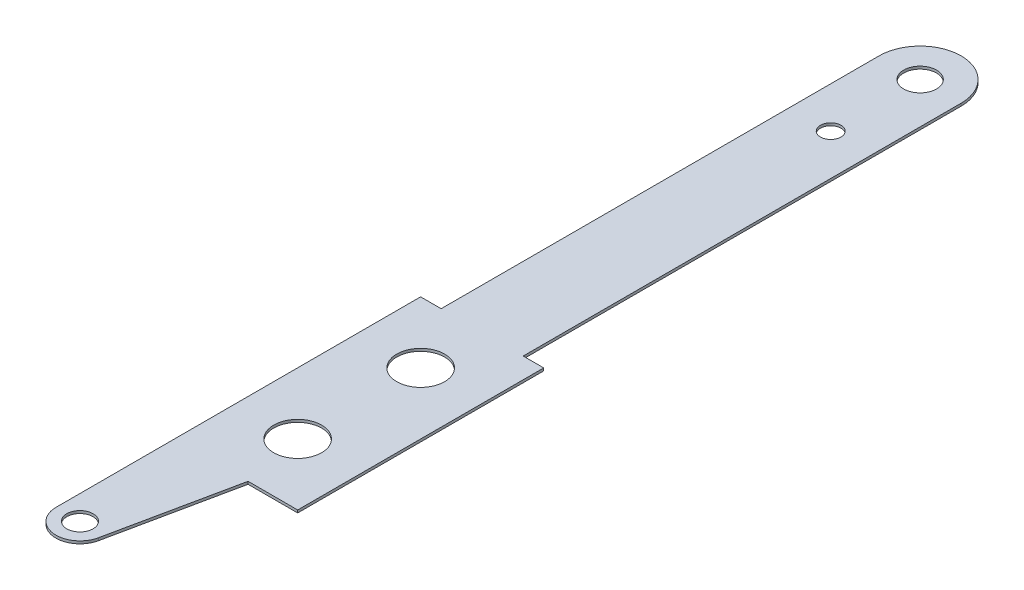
ISO-10303-21;
HEADER;
FILE_DESCRIPTION(('STEP AP214'),'2;1');
FILE_NAME('part.step','',(''),(''),'','','');
FILE_SCHEMA(('AUTOMOTIVE_DESIGN { 1 0 10303 214 1 1 1 1 }'));
ENDSEC;
DATA;
#1=APPLICATION_CONTEXT('core data for automotive mechanical design processes');
#2=APPLICATION_PROTOCOL_DEFINITION('international standard','automotive_design',2000,#1);
#3=PRODUCT_CONTEXT('',#1,'mechanical');
#4=PRODUCT('Part','Part','',(#3));
#5=PRODUCT_RELATED_PRODUCT_CATEGORY('part','',(#4));
#6=PRODUCT_DEFINITION_FORMATION('','',#4);
#7=PRODUCT_DEFINITION_CONTEXT('part definition',#1,'design');
#8=PRODUCT_DEFINITION('design','',#6,#7);
#9=PRODUCT_DEFINITION_SHAPE('','',#8);
#10=(LENGTH_UNIT() NAMED_UNIT(*) SI_UNIT(.MILLI.,.METRE.));
#11=(NAMED_UNIT(*) PLANE_ANGLE_UNIT() SI_UNIT($,.RADIAN.));
#12=(NAMED_UNIT(*) SI_UNIT($,.STERADIAN.) SOLID_ANGLE_UNIT());
#13=UNCERTAINTY_MEASURE_WITH_UNIT(LENGTH_MEASURE(1.E-05),#10,'distance_accuracy_value','');
#14=(GEOMETRIC_REPRESENTATION_CONTEXT(3) GLOBAL_UNCERTAINTY_ASSIGNED_CONTEXT((#13)) GLOBAL_UNIT_ASSIGNED_CONTEXT((#10,
#11,#12)) REPRESENTATION_CONTEXT('',''));
#15=CARTESIAN_POINT('',(0.,0.,0.));
#16=DIRECTION('',(0.,0.,1.));
#17=DIRECTION('',(1.,0.,0.));
#18=AXIS2_PLACEMENT_3D('',#15,#16,#17);
#19=CARTESIAN_POINT('',(-4.76631,-0.2032,9.525));
#20=DIRECTION('',(0.,0.,1.));
#21=DIRECTION('',(1.,0.,0.));
#22=AXIS2_PLACEMENT_3D('',#19,#20,#21);
#23=PLANE('',#22);
#24=DIRECTION('',(1.,0.,0.));
#25=VECTOR('',#24,1.);
#26=CARTESIAN_POINT('',(-4.76631,0.,9.525));
#27=LINE('',#26,#25);
#28=CARTESIAN_POINT('',(0.923290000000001,0.,9.525));
#29=VERTEX_POINT('',#28);
#30=CARTESIAN_POINT('',(4.76631,0.,9.525));
#31=VERTEX_POINT('',#30);
#32=EDGE_CURVE('E138',#29,#31,#27,.T.);
#33=ORIENTED_EDGE('',*,*,#32,.F.);
#34=DIRECTION('',(0.,-1.,0.));
#35=VECTOR('',#34,1.);
#36=CARTESIAN_POINT('',(0.923290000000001,0.,9.525));
#37=LINE('',#36,#35);
#38=CARTESIAN_POINT('',(0.923289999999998,-0.2032,9.525));
#39=VERTEX_POINT('',#38);
#40=EDGE_CURVE('E120',#29,#39,#37,.T.);
#41=ORIENTED_EDGE('',*,*,#40,.T.);
#42=DIRECTION('',(1.,0.,0.));
#43=VECTOR('',#42,1.);
#44=CARTESIAN_POINT('',(-4.76631,-0.2032,9.525));
#45=LINE('',#44,#43);
#46=CARTESIAN_POINT('',(4.76631,-0.2032,9.525));
#47=VERTEX_POINT('',#46);
#48=EDGE_CURVE('E159',#39,#47,#45,.T.);
#49=ORIENTED_EDGE('',*,*,#48,.T.);
#50=DIRECTION('',(0.,1.,0.));
#51=VECTOR('',#50,1.);
#52=CARTESIAN_POINT('',(4.76631,-0.2032,9.525));
#53=LINE('',#52,#51);
#54=EDGE_CURVE('E144',#47,#31,#53,.T.);
#55=ORIENTED_EDGE('',*,*,#54,.T.);
#56=EDGE_LOOP('',(#33,#41,#49,#55));
#57=FACE_BOUND('',#56,.T.);
#58=ADVANCED_FACE('F37',(#57),#23,.T.);
#59=CARTESIAN_POINT('',(-4.76631,-0.2032,-9.525));
#60=DIRECTION('',(0.,0.,-1.));
#61=DIRECTION('',(-1.,0.,0.));
#62=AXIS2_PLACEMENT_3D('',#59,#60,#61);
#63=PLANE('',#62);
#64=DIRECTION('',(-1.,0.,0.));
#65=VECTOR('',#64,1.);
#66=CARTESIAN_POINT('',(-4.76631,-0.2032,-9.525));
#67=LINE('',#66,#65);
#68=CARTESIAN_POINT('',(4.76631,-0.2032,-9.525));
#69=VERTEX_POINT('',#68);
#70=CARTESIAN_POINT('',(3.175,-0.2032,-9.525));
#71=VERTEX_POINT('',#70);
#72=EDGE_CURVE('E185',#69,#71,#67,.T.);
#73=ORIENTED_EDGE('',*,*,#72,.T.);
#74=DIRECTION('',(0.,1.,0.));
#75=VECTOR('',#74,1.);
#76=CARTESIAN_POINT('',(3.175,-0.2032,-9.525));
#77=LINE('',#76,#75);
#78=CARTESIAN_POINT('',(3.17499999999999,0.,-9.525));
#79=VERTEX_POINT('',#78);
#80=EDGE_CURVE('E249',#71,#79,#77,.T.);
#81=ORIENTED_EDGE('',*,*,#80,.T.);
#82=DIRECTION('',(-1.,0.,0.));
#83=VECTOR('',#82,1.);
#84=CARTESIAN_POINT('',(-4.76631,0.,-9.525));
#85=LINE('',#84,#83);
#86=CARTESIAN_POINT('',(4.76631,0.,-9.525));
#87=VERTEX_POINT('',#86);
#88=EDGE_CURVE('E152',#87,#79,#85,.T.);
#89=ORIENTED_EDGE('',*,*,#88,.F.);
#90=DIRECTION('',(0.,1.,0.));
#91=VECTOR('',#90,1.);
#92=CARTESIAN_POINT('',(4.76631,-0.2032,-9.525));
#93=LINE('',#92,#91);
#94=EDGE_CURVE('E170',#69,#87,#93,.T.);
#95=ORIENTED_EDGE('',*,*,#94,.F.);
#96=EDGE_LOOP('',(#73,#81,#89,#95));
#97=FACE_BOUND('',#96,.T.);
#98=ADVANCED_FACE('F285',(#97),#63,.T.);
#99=CARTESIAN_POINT('',(4.76631,-0.2032,9.525));
#100=DIRECTION('',(1.,0.,0.));
#101=DIRECTION('',(0.,0.,-1.));
#102=AXIS2_PLACEMENT_3D('',#99,#100,#101);
#103=PLANE('',#102);
#104=DIRECTION('',(0.,0.,-1.));
#105=VECTOR('',#104,1.);
#106=CARTESIAN_POINT('',(4.76631,0.,9.525));
#107=LINE('',#106,#105);
#108=EDGE_CURVE('E178',#31,#87,#107,.T.);
#109=ORIENTED_EDGE('',*,*,#108,.F.);
#110=ORIENTED_EDGE('',*,*,#54,.F.);
#111=DIRECTION('',(0.,0.,-1.));
#112=VECTOR('',#111,1.);
#113=CARTESIAN_POINT('',(4.76631,-0.2032,9.525));
#114=LINE('',#113,#112);
#115=EDGE_CURVE('E146',#47,#69,#114,.T.);
#116=ORIENTED_EDGE('',*,*,#115,.T.);
#117=ORIENTED_EDGE('',*,*,#94,.T.);
#118=EDGE_LOOP('',(#109,#110,#116,#117));
#119=FACE_BOUND('',#118,.T.);
#120=ADVANCED_FACE('F289',(#119),#103,.T.);
#121=CARTESIAN_POINT('',(-4.76631,-0.2032,9.525));
#122=DIRECTION('',(-1.,0.,0.));
#123=DIRECTION('',(0.,0.,1.));
#124=AXIS2_PLACEMENT_3D('',#121,#122,#123);
#125=PLANE('',#124);
#126=DIRECTION('',(0.,0.,1.));
#127=VECTOR('',#126,1.);
#128=CARTESIAN_POINT('',(-4.76631,0.,9.525));
#129=LINE('',#128,#127);
#130=CARTESIAN_POINT('',(-4.76631,0.,-9.525));
#131=VERTEX_POINT('',#130);
#132=CARTESIAN_POINT('',(-4.76631,0.,18.7126917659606));
#133=VERTEX_POINT('',#132);
#134=EDGE_CURVE('E147',#131,#133,#129,.T.);
#135=ORIENTED_EDGE('',*,*,#134,.F.);
#136=DIRECTION('',(0.,1.,0.));
#137=VECTOR('',#136,1.);
#138=CARTESIAN_POINT('',(-4.76631,-0.2032,-9.525));
#139=LINE('',#138,#137);
#140=CARTESIAN_POINT('',(-4.76631,-0.2032,-9.525));
#141=VERTEX_POINT('',#140);
#142=EDGE_CURVE('E167',#141,#131,#139,.T.);
#143=ORIENTED_EDGE('',*,*,#142,.F.);
#144=DIRECTION('',(0.,0.,1.));
#145=VECTOR('',#144,1.);
#146=CARTESIAN_POINT('',(-4.76631,-0.2032,9.525));
#147=LINE('',#146,#145);
#148=CARTESIAN_POINT('',(-4.76631,-0.2032,18.7126917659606));
#149=VERTEX_POINT('',#148);
#150=EDGE_CURVE('E183',#141,#149,#147,.T.);
#151=ORIENTED_EDGE('',*,*,#150,.T.);
#152=DIRECTION('',(0.,-1.,0.));
#153=VECTOR('',#152,1.);
#154=CARTESIAN_POINT('',(-4.76631,0.,18.7126917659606));
#155=LINE('',#154,#153);
#156=EDGE_CURVE('E219',#133,#149,#155,.T.);
#157=ORIENTED_EDGE('',*,*,#156,.F.);
#158=EDGE_LOOP('',(#135,#143,#151,#157));
#159=FACE_BOUND('',#158,.T.);
#160=ADVANCED_FACE('F206',(#159),#125,.T.);
#161=DIRECTION('',(0.,1.,0.));
#162=VECTOR('',#161,1.);
#163=CARTESIAN_POINT('',(-3.175,-0.2032,-9.525));
#164=LINE('',#163,#162);
#165=CARTESIAN_POINT('',(-3.175,-0.2032,-9.525));
#166=VERTEX_POINT('',#165);
#167=CARTESIAN_POINT('',(-3.175,0.,-9.525));
#168=VERTEX_POINT('',#167);
#169=EDGE_CURVE('E203',#166,#168,#164,.T.);
#170=ORIENTED_EDGE('',*,*,#169,.F.);
#171=EDGE_CURVE('E150',#166,#141,#67,.T.);
#172=ORIENTED_EDGE('',*,*,#171,.T.);
#173=ORIENTED_EDGE('',*,*,#142,.T.);
#174=EDGE_CURVE('E174',#168,#131,#85,.T.);
#175=ORIENTED_EDGE('',*,*,#174,.F.);
#176=EDGE_LOOP('',(#170,#172,#173,#175));
#177=FACE_BOUND('',#176,.T.);
#178=ADVANCED_FACE('F199',(#177),#63,.T.);
#179=CARTESIAN_POINT('',(0.,-0.2032,0.));
#180=DIRECTION('',(0.,-1.,0.));
#181=DIRECTION('',(0.,0.,-1.));
#182=AXIS2_PLACEMENT_3D('',#179,#180,#181);
#183=PLANE('',#182);
#184=CARTESIAN_POINT('',(0.,-0.2032,-43.434));
#185=DIRECTION('',(0.,-1.,0.));
#186=DIRECTION('',(0.,0.,-1.));
#187=AXIS2_PLACEMENT_3D('',#184,#185,#186);
#188=CIRCLE('',#187,1.27);
#189=CARTESIAN_POINT('',(0.,-0.2032,-44.704));
#190=VERTEX_POINT('',#189);
#191=EDGE_CURVE('E362',#190,#190,#188,.T.);
#192=ORIENTED_EDGE('',*,*,#191,.F.);
#193=EDGE_LOOP('',(#192));
#194=FACE_BOUND('',#193,.T.);
#195=CARTESIAN_POINT('',(0.,-0.2032,-36.5125));
#196=DIRECTION('',(0.,1.,0.));
#197=DIRECTION('',(0.,0.,1.));
#198=AXIS2_PLACEMENT_3D('',#195,#196,#197);
#199=CIRCLE('',#198,0.79375);
#200=CARTESIAN_POINT('',(0.,-0.2032,-35.71875));
#201=VERTEX_POINT('',#200);
#202=EDGE_CURVE('E225',#201,#201,#199,.T.);
#203=ORIENTED_EDGE('',*,*,#202,.T.);
#204=EDGE_LOOP('',(#203));
#205=FACE_BOUND('',#204,.T.);
#206=CARTESIAN_POINT('',(0.,-0.2032,4.7625));
#207=DIRECTION('',(0.,1.,0.));
#208=DIRECTION('',(0.,0.,-1.));
#209=AXIS2_PLACEMENT_3D('',#206,#207,#208);
#210=CIRCLE('',#209,1.8542);
#211=CARTESIAN_POINT('',(0.,-0.2032,2.9083));
#212=VERTEX_POINT('',#211);
#213=EDGE_CURVE('E256',#212,#212,#210,.T.);
#214=ORIENTED_EDGE('',*,*,#213,.T.);
#215=EDGE_LOOP('',(#214));
#216=FACE_BOUND('',#215,.T.);
#217=CARTESIAN_POINT('',(0.,-0.2032,-4.7625));
#218=DIRECTION('',(0.,1.,0.));
#219=DIRECTION('',(0.,0.,1.));
#220=AXIS2_PLACEMENT_3D('',#217,#218,#219);
#221=CIRCLE('',#220,1.8542);
#222=CARTESIAN_POINT('',(0.,-0.2032,-2.9083));
#223=VERTEX_POINT('',#222);
#224=EDGE_CURVE('E180',#223,#223,#221,.T.);
#225=ORIENTED_EDGE('',*,*,#224,.T.);
#226=EDGE_LOOP('',(#225));
#227=FACE_BOUND('',#226,.T.);
#228=CARTESIAN_POINT('',(0.,-0.2032,-43.434));
#229=DIRECTION('',(0.,-1.,0.));
#230=DIRECTION('',(0.,0.,-1.));
#231=AXIS2_PLACEMENT_3D('',#228,#229,#230);
#232=CIRCLE('',#231,3.175);
#233=CARTESIAN_POINT('',(-3.175,-0.2032,-43.434));
#234=VERTEX_POINT('',#233);
#235=CARTESIAN_POINT('',(0.,-0.2032,-46.609));
#236=VERTEX_POINT('',#235);
#237=EDGE_CURVE('E53',#234,#236,#232,.T.);
#238=ORIENTED_EDGE('',*,*,#237,.T.);
#239=CARTESIAN_POINT('',(0.,-0.2032,-43.434));
#240=DIRECTION('',(0.,-1.,0.));
#241=DIRECTION('',(0.,0.,-1.));
#242=AXIS2_PLACEMENT_3D('',#239,#240,#241);
#243=CIRCLE('',#242,3.175);
#244=CARTESIAN_POINT('',(3.175,-0.2032,-43.434));
#245=VERTEX_POINT('',#244);
#246=EDGE_CURVE('E46',#236,#245,#243,.T.);
#247=ORIENTED_EDGE('',*,*,#246,.T.);
#248=DIRECTION('',(0.,0.,-1.));
#249=VECTOR('',#248,1.);
#250=CARTESIAN_POINT('',(3.175,-0.2032,-46.609));
#251=LINE('',#250,#249);
#252=EDGE_CURVE('E237',#71,#245,#251,.T.);
#253=ORIENTED_EDGE('',*,*,#252,.F.);
#254=ORIENTED_EDGE('',*,*,#72,.F.);
#255=ORIENTED_EDGE('',*,*,#115,.F.);
#256=ORIENTED_EDGE('',*,*,#48,.F.);
#257=DIRECTION('',(-0.205220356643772,0.,0.978715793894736));
#258=VECTOR('',#257,1.);
#259=CARTESIAN_POINT('',(0.923290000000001,-0.2032,9.525));
#260=LINE('',#259,#258);
#261=CARTESIAN_POINT('',(-1.08331,-0.2032,19.0946701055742));
#262=VERTEX_POINT('',#261);
#263=EDGE_CURVE('E125',#39,#262,#260,.T.);
#264=ORIENTED_EDGE('',*,*,#263,.T.);
#265=CARTESIAN_POINT('',(-2.90500176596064,-0.2032,18.7126917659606));
#266=DIRECTION('',(0.,-1.,0.));
#267=DIRECTION('',(0.,0.,1.));
#268=AXIS2_PLACEMENT_3D('',#265,#266,#267);
#269=CIRCLE('',#268,1.86130823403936);
#270=EDGE_CURVE('E141',#262,#149,#269,.T.);
#271=ORIENTED_EDGE('',*,*,#270,.T.);
#272=ORIENTED_EDGE('',*,*,#150,.F.);
#273=ORIENTED_EDGE('',*,*,#171,.F.);
#274=DIRECTION('',(0.,0.,1.));
#275=VECTOR('',#274,1.);
#276=CARTESIAN_POINT('',(-3.175,-0.2032,-46.609));
#277=LINE('',#276,#275);
#278=EDGE_CURVE('E242',#234,#166,#277,.T.);
#279=ORIENTED_EDGE('',*,*,#278,.F.);
#280=EDGE_LOOP('',(#238,#247,#253,#254,#255,#256,#264,#271,#272,#273,#279));
#281=FACE_BOUND('',#280,.T.);
#282=CARTESIAN_POINT('',(-2.90500176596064,-0.2032,18.7126917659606));
#283=DIRECTION('',(0.,-1.,0.));
#284=DIRECTION('',(0.,0.,-1.));
#285=AXIS2_PLACEMENT_3D('',#282,#283,#284);
#286=CIRCLE('',#285,1.016);
#287=CARTESIAN_POINT('',(-2.90500176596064,-0.2032,17.6966917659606));
#288=VERTEX_POINT('',#287);
#289=EDGE_CURVE('E358',#288,#288,#286,.T.);
#290=ORIENTED_EDGE('',*,*,#289,.F.);
#291=EDGE_LOOP('',(#290));
#292=FACE_BOUND('',#291,.T.);
#293=ADVANCED_FACE('F210',(#194,#205,#216,#227,#281,#292),#183,.T.);
#294=CARTESIAN_POINT('',(0.,0.,0.));
#295=DIRECTION('',(0.,-1.,0.));
#296=DIRECTION('',(0.,0.,-1.));
#297=AXIS2_PLACEMENT_3D('',#294,#295,#296);
#298=PLANE('',#297);
#299=CARTESIAN_POINT('',(0.,0.,-43.434));
#300=DIRECTION('',(0.,-1.,0.));
#301=DIRECTION('',(0.,0.,-1.));
#302=AXIS2_PLACEMENT_3D('',#299,#300,#301);
#303=CIRCLE('',#302,1.27);
#304=CARTESIAN_POINT('',(0.,0.,-44.704));
#305=VERTEX_POINT('',#304);
#306=EDGE_CURVE('E360',#305,#305,#303,.T.);
#307=ORIENTED_EDGE('',*,*,#306,.T.);
#308=EDGE_LOOP('',(#307));
#309=FACE_BOUND('',#308,.T.);
#310=CARTESIAN_POINT('',(0.,0.,-36.5125));
#311=DIRECTION('',(0.,1.,0.));
#312=DIRECTION('',(0.,0.,1.));
#313=AXIS2_PLACEMENT_3D('',#310,#311,#312);
#314=CIRCLE('',#313,0.79375);
#315=CARTESIAN_POINT('',(0.,0.,-35.71875));
#316=VERTEX_POINT('',#315);
#317=EDGE_CURVE('E221',#316,#316,#314,.T.);
#318=ORIENTED_EDGE('',*,*,#317,.F.);
#319=EDGE_LOOP('',(#318));
#320=FACE_BOUND('',#319,.T.);
#321=CARTESIAN_POINT('',(0.,0.,4.7625));
#322=DIRECTION('',(0.,1.,0.));
#323=DIRECTION('',(0.,0.,-1.));
#324=AXIS2_PLACEMENT_3D('',#321,#322,#323);
#325=CIRCLE('',#324,1.8542);
#326=CARTESIAN_POINT('',(0.,0.,2.9083));
#327=VERTEX_POINT('',#326);
#328=EDGE_CURVE('E260',#327,#327,#325,.T.);
#329=ORIENTED_EDGE('',*,*,#328,.F.);
#330=EDGE_LOOP('',(#329));
#331=FACE_BOUND('',#330,.T.);
#332=CARTESIAN_POINT('',(0.,0.,-4.7625));
#333=DIRECTION('',(0.,1.,0.));
#334=DIRECTION('',(0.,0.,1.));
#335=AXIS2_PLACEMENT_3D('',#332,#333,#334);
#336=CIRCLE('',#335,1.8542);
#337=CARTESIAN_POINT('',(0.,0.,-2.9083));
#338=VERTEX_POINT('',#337);
#339=EDGE_CURVE('E259',#338,#338,#336,.T.);
#340=ORIENTED_EDGE('',*,*,#339,.F.);
#341=EDGE_LOOP('',(#340));
#342=FACE_BOUND('',#341,.T.);
#343=DIRECTION('',(0.,0.,-1.));
#344=VECTOR('',#343,1.);
#345=CARTESIAN_POINT('',(3.175,0.,-46.609));
#346=LINE('',#345,#344);
#347=CARTESIAN_POINT('',(3.175,0.,-43.434));
#348=VERTEX_POINT('',#347);
#349=EDGE_CURVE('E238',#79,#348,#346,.T.);
#350=ORIENTED_EDGE('',*,*,#349,.T.);
#351=CARTESIAN_POINT('',(0.,0.,-43.434));
#352=DIRECTION('',(0.,-1.,0.));
#353=DIRECTION('',(0.,0.,-1.));
#354=AXIS2_PLACEMENT_3D('',#351,#352,#353);
#355=CIRCLE('',#354,3.175);
#356=CARTESIAN_POINT('',(0.,0.,-46.609));
#357=VERTEX_POINT('',#356);
#358=EDGE_CURVE('E240',#348,#357,#355,.F.);
#359=ORIENTED_EDGE('',*,*,#358,.T.);
#360=CARTESIAN_POINT('',(0.,0.,-43.434));
#361=DIRECTION('',(0.,-1.,0.));
#362=DIRECTION('',(0.,0.,-1.));
#363=AXIS2_PLACEMENT_3D('',#360,#361,#362);
#364=CIRCLE('',#363,3.175);
#365=CARTESIAN_POINT('',(-3.175,0.,-43.434));
#366=VERTEX_POINT('',#365);
#367=EDGE_CURVE('E234',#357,#366,#364,.F.);
#368=ORIENTED_EDGE('',*,*,#367,.T.);
#369=DIRECTION('',(0.,0.,1.));
#370=VECTOR('',#369,1.);
#371=CARTESIAN_POINT('',(-3.175,0.,-46.609));
#372=LINE('',#371,#370);
#373=EDGE_CURVE('E235',#366,#168,#372,.T.);
#374=ORIENTED_EDGE('',*,*,#373,.T.);
#375=ORIENTED_EDGE('',*,*,#174,.T.);
#376=ORIENTED_EDGE('',*,*,#134,.T.);
#377=CARTESIAN_POINT('',(-2.90500176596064,0.,18.7126917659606));
#378=DIRECTION('',(0.,-1.,0.));
#379=DIRECTION('',(0.,0.,1.));
#380=AXIS2_PLACEMENT_3D('',#377,#378,#379);
#381=CIRCLE('',#380,1.86130823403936);
#382=CARTESIAN_POINT('',(-1.08331,0.,19.0946701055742));
#383=VERTEX_POINT('',#382);
#384=EDGE_CURVE('E130',#383,#133,#381,.T.);
#385=ORIENTED_EDGE('',*,*,#384,.F.);
#386=DIRECTION('',(-0.205220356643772,0.,0.978715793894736));
#387=VECTOR('',#386,1.);
#388=CARTESIAN_POINT('',(0.923290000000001,0.,9.525));
#389=LINE('',#388,#387);
#390=EDGE_CURVE('E123',#29,#383,#389,.T.);
#391=ORIENTED_EDGE('',*,*,#390,.F.);
#392=ORIENTED_EDGE('',*,*,#32,.T.);
#393=ORIENTED_EDGE('',*,*,#108,.T.);
#394=ORIENTED_EDGE('',*,*,#88,.T.);
#395=EDGE_LOOP('',(#350,#359,#368,#374,#375,#376,#385,#391,#392,#393,#394));
#396=FACE_BOUND('',#395,.T.);
#397=CARTESIAN_POINT('',(-2.90500176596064,0.,18.7126917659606));
#398=DIRECTION('',(0.,-1.,0.));
#399=DIRECTION('',(0.,0.,-1.));
#400=AXIS2_PLACEMENT_3D('',#397,#398,#399);
#401=CIRCLE('',#400,1.016);
#402=CARTESIAN_POINT('',(-2.90500176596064,0.,17.6966917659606));
#403=VERTEX_POINT('',#402);
#404=EDGE_CURVE('E215',#403,#403,#401,.T.);
#405=ORIENTED_EDGE('',*,*,#404,.T.);
#406=EDGE_LOOP('',(#405));
#407=FACE_BOUND('',#406,.T.);
#408=ADVANCED_FACE('F135',(#309,#320,#331,#342,#396,#407),#298,.F.);
#409=CARTESIAN_POINT('',(0.,-0.2032,-4.7625));
#410=DIRECTION('',(0.,1.,0.));
#411=DIRECTION('',(0.,0.,1.));
#412=AXIS2_PLACEMENT_3D('',#409,#410,#411);
#413=CYLINDRICAL_SURFACE('',#412,1.8542);
#414=ORIENTED_EDGE('',*,*,#224,.F.);
#415=EDGE_LOOP('',(#414));
#416=FACE_BOUND('',#415,.T.);
#417=ORIENTED_EDGE('',*,*,#339,.T.);
#418=EDGE_LOOP('',(#417));
#419=FACE_BOUND('',#418,.T.);
#420=ADVANCED_FACE('F267',(#416,#419),#413,.F.);
#421=CARTESIAN_POINT('',(0.,-0.2032,4.7625));
#422=DIRECTION('',(0.,1.,0.));
#423=DIRECTION('',(0.,0.,1.));
#424=AXIS2_PLACEMENT_3D('',#421,#422,#423);
#425=CYLINDRICAL_SURFACE('',#424,1.8542);
#426=ORIENTED_EDGE('',*,*,#213,.F.);
#427=EDGE_LOOP('',(#426));
#428=FACE_BOUND('',#427,.T.);
#429=ORIENTED_EDGE('',*,*,#328,.T.);
#430=EDGE_LOOP('',(#429));
#431=FACE_BOUND('',#430,.T.);
#432=ADVANCED_FACE('F276',(#428,#431),#425,.F.);
#433=CARTESIAN_POINT('',(3.175,-0.2032,-46.609));
#434=DIRECTION('',(1.,0.,0.));
#435=DIRECTION('',(0.,0.,-1.));
#436=AXIS2_PLACEMENT_3D('',#433,#434,#435);
#437=PLANE('',#436);
#438=ORIENTED_EDGE('',*,*,#252,.T.);
#439=DIRECTION('',(0.,1.,0.));
#440=VECTOR('',#439,1.);
#441=CARTESIAN_POINT('',(3.175,-0.2032,-43.434));
#442=LINE('',#441,#440);
#443=EDGE_CURVE('E166',#245,#348,#442,.T.);
#444=ORIENTED_EDGE('',*,*,#443,.T.);
#445=ORIENTED_EDGE('',*,*,#349,.F.);
#446=ORIENTED_EDGE('',*,*,#80,.F.);
#447=EDGE_LOOP('',(#438,#444,#445,#446));
#448=FACE_BOUND('',#447,.T.);
#449=ADVANCED_FACE('F315',(#448),#437,.T.);
#450=CARTESIAN_POINT('',(-3.175,-0.2032,-46.609));
#451=DIRECTION('',(-1.,0.,0.));
#452=DIRECTION('',(0.,0.,1.));
#453=AXIS2_PLACEMENT_3D('',#450,#451,#452);
#454=PLANE('',#453);
#455=ORIENTED_EDGE('',*,*,#373,.F.);
#456=DIRECTION('',(0.,1.,0.));
#457=VECTOR('',#456,1.);
#458=CARTESIAN_POINT('',(-3.175,-0.2032,-43.434));
#459=LINE('',#458,#457);
#460=EDGE_CURVE('E11',#366,#234,#459,.F.);
#461=ORIENTED_EDGE('',*,*,#460,.T.);
#462=ORIENTED_EDGE('',*,*,#278,.T.);
#463=ORIENTED_EDGE('',*,*,#169,.T.);
#464=EDGE_LOOP('',(#455,#461,#462,#463));
#465=FACE_BOUND('',#464,.T.);
#466=ADVANCED_FACE('F335',(#465),#454,.T.);
#467=CARTESIAN_POINT('',(0.,-0.2032,-36.5125));
#468=DIRECTION('',(0.,1.,0.));
#469=DIRECTION('',(0.,0.,1.));
#470=AXIS2_PLACEMENT_3D('',#467,#468,#469);
#471=CYLINDRICAL_SURFACE('',#470,0.79375);
#472=ORIENTED_EDGE('',*,*,#202,.F.);
#473=EDGE_LOOP('',(#472));
#474=FACE_BOUND('',#473,.T.);
#475=ORIENTED_EDGE('',*,*,#317,.T.);
#476=EDGE_LOOP('',(#475));
#477=FACE_BOUND('',#476,.T.);
#478=ADVANCED_FACE('F325',(#474,#477),#471,.F.);
#479=CARTESIAN_POINT('',(-2.90500176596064,0.,18.7126917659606));
#480=DIRECTION('',(0.,-1.,0.));
#481=DIRECTION('',(0.,0.,-1.));
#482=AXIS2_PLACEMENT_3D('',#479,#480,#481);
#483=CYLINDRICAL_SURFACE('',#482,1.86130823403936);
#484=ORIENTED_EDGE('',*,*,#270,.F.);
#485=DIRECTION('',(0.,-1.,0.));
#486=VECTOR('',#485,1.);
#487=CARTESIAN_POINT('',(-1.08331,0.,19.0946701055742));
#488=LINE('',#487,#486);
#489=EDGE_CURVE('E129',#383,#262,#488,.T.);
#490=ORIENTED_EDGE('',*,*,#489,.F.);
#491=ORIENTED_EDGE('',*,*,#384,.T.);
#492=ORIENTED_EDGE('',*,*,#156,.T.);
#493=EDGE_LOOP('',(#484,#490,#491,#492));
#494=FACE_BOUND('',#493,.T.);
#495=ADVANCED_FACE('F343',(#494),#483,.T.);
#496=CARTESIAN_POINT('',(0.923290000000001,0.,9.525));
#497=DIRECTION('',(0.978715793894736,0.,0.205220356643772));
#498=DIRECTION('',(0.205220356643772,0.,-0.978715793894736));
#499=AXIS2_PLACEMENT_3D('',#496,#497,#498);
#500=PLANE('',#499);
#501=ORIENTED_EDGE('',*,*,#263,.F.);
#502=ORIENTED_EDGE('',*,*,#40,.F.);
#503=ORIENTED_EDGE('',*,*,#390,.T.);
#504=ORIENTED_EDGE('',*,*,#489,.T.);
#505=EDGE_LOOP('',(#501,#502,#503,#504));
#506=FACE_BOUND('',#505,.T.);
#507=ADVANCED_FACE('F122',(#506),#500,.T.);
#508=CARTESIAN_POINT('',(-2.90500176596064,0.,18.7126917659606));
#509=DIRECTION('',(0.,-1.,0.));
#510=DIRECTION('',(0.,0.,-1.));
#511=AXIS2_PLACEMENT_3D('',#508,#509,#510);
#512=CYLINDRICAL_SURFACE('',#511,1.016);
#513=ORIENTED_EDGE('',*,*,#404,.F.);
#514=EDGE_LOOP('',(#513));
#515=FACE_BOUND('',#514,.T.);
#516=ORIENTED_EDGE('',*,*,#289,.T.);
#517=EDGE_LOOP('',(#516));
#518=FACE_BOUND('',#517,.T.);
#519=ADVANCED_FACE('F307',(#515,#518),#512,.F.);
#520=CARTESIAN_POINT('',(0.,-0.2032,-43.434));
#521=DIRECTION('',(0.,1.,0.));
#522=DIRECTION('',(0.,0.,1.));
#523=AXIS2_PLACEMENT_3D('',#520,#521,#522);
#524=CYLINDRICAL_SURFACE('',#523,3.175);
#525=DIRECTION('',(0.,1.,0.));
#526=VECTOR('',#525,1.);
#527=CARTESIAN_POINT('',(0.,-0.2032,-46.609));
#528=LINE('',#527,#526);
#529=EDGE_CURVE('E41',#236,#357,#528,.T.);
#530=ORIENTED_EDGE('',*,*,#529,.F.);
#531=ORIENTED_EDGE('',*,*,#237,.F.);
#532=ORIENTED_EDGE('',*,*,#460,.F.);
#533=ORIENTED_EDGE('',*,*,#367,.F.);
#534=EDGE_LOOP('',(#530,#531,#532,#533));
#535=FACE_BOUND('',#534,.T.);
#536=ADVANCED_FACE('F39',(#535),#524,.T.);
#537=CARTESIAN_POINT('',(0.,-0.2032,-43.434));
#538=DIRECTION('',(0.,1.,0.));
#539=DIRECTION('',(0.,0.,1.));
#540=AXIS2_PLACEMENT_3D('',#537,#538,#539);
#541=CYLINDRICAL_SURFACE('',#540,3.175);
#542=ORIENTED_EDGE('',*,*,#246,.F.);
#543=ORIENTED_EDGE('',*,*,#529,.T.);
#544=ORIENTED_EDGE('',*,*,#358,.F.);
#545=ORIENTED_EDGE('',*,*,#443,.F.);
#546=EDGE_LOOP('',(#542,#543,#544,#545));
#547=FACE_BOUND('',#546,.T.);
#548=ADVANCED_FACE('F297',(#547),#541,.T.);
#549=CARTESIAN_POINT('',(0.,0.,-43.434));
#550=DIRECTION('',(0.,-1.,0.));
#551=DIRECTION('',(0.,0.,-1.));
#552=AXIS2_PLACEMENT_3D('',#549,#550,#551);
#553=CYLINDRICAL_SURFACE('',#552,1.27);
#554=ORIENTED_EDGE('',*,*,#306,.F.);
#555=EDGE_LOOP('',(#554));
#556=FACE_BOUND('',#555,.T.);
#557=ORIENTED_EDGE('',*,*,#191,.T.);
#558=EDGE_LOOP('',(#557));
#559=FACE_BOUND('',#558,.T.);
#560=ADVANCED_FACE('F299',(#556,#559),#553,.F.);
#561=CLOSED_SHELL('',(#58,#98,#120,#160,#178,#293,#408,#420,#432,#449,#466,#478,#495,#507,#519,
#536,#548,#560));
#562=MANIFOLD_SOLID_BREP('B2',#561);
#563=ADVANCED_BREP_SHAPE_REPRESENTATION('',(#18,#562),#14);
#564=SHAPE_DEFINITION_REPRESENTATION(#9,#563);
ENDSEC;
END-ISO-10303-21;
